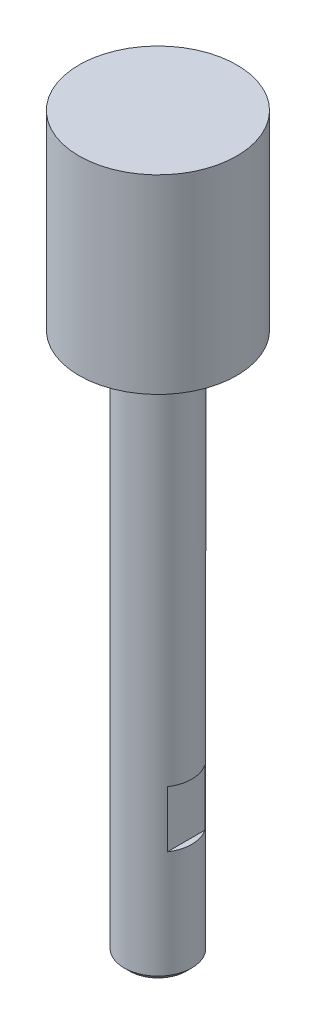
ISO-10303-21;
HEADER;
FILE_DESCRIPTION(('STEP AP214'),'2;1');
FILE_NAME('part.step','',(''),(''),'','','');
FILE_SCHEMA(('AUTOMOTIVE_DESIGN { 1 0 10303 214 1 1 1 1 }'));
ENDSEC;
DATA;
#1=APPLICATION_CONTEXT('core data for automotive mechanical design processes');
#2=APPLICATION_PROTOCOL_DEFINITION('international standard','automotive_design',2000,#1);
#3=PRODUCT_CONTEXT('',#1,'mechanical');
#4=PRODUCT('Part','Part','',(#3));
#5=PRODUCT_RELATED_PRODUCT_CATEGORY('part','',(#4));
#6=PRODUCT_DEFINITION_FORMATION('','',#4);
#7=PRODUCT_DEFINITION_CONTEXT('part definition',#1,'design');
#8=PRODUCT_DEFINITION('design','',#6,#7);
#9=PRODUCT_DEFINITION_SHAPE('','',#8);
#10=(LENGTH_UNIT() NAMED_UNIT(*) SI_UNIT(.MILLI.,.METRE.));
#11=(NAMED_UNIT(*) PLANE_ANGLE_UNIT() SI_UNIT($,.RADIAN.));
#12=(NAMED_UNIT(*) SI_UNIT($,.STERADIAN.) SOLID_ANGLE_UNIT());
#13=UNCERTAINTY_MEASURE_WITH_UNIT(LENGTH_MEASURE(1.E-05),#10,'distance_accuracy_value','');
#14=(GEOMETRIC_REPRESENTATION_CONTEXT(3) GLOBAL_UNCERTAINTY_ASSIGNED_CONTEXT((#13)) GLOBAL_UNIT_ASSIGNED_CONTEXT((#10,
#11,#12)) REPRESENTATION_CONTEXT('',''));
#15=CARTESIAN_POINT('',(0.,0.,0.));
#16=DIRECTION('',(0.,0.,1.));
#17=DIRECTION('',(1.,0.,0.));
#18=AXIS2_PLACEMENT_3D('',#15,#16,#17);
#19=CARTESIAN_POINT('',(0.,0.,0.));
#20=DIRECTION('',(0.,1.,0.));
#21=DIRECTION('',(0.,0.,1.));
#22=AXIS2_PLACEMENT_3D('',#19,#20,#21);
#23=PLANE('',#22);
#24=CARTESIAN_POINT('',(0.,0.,0.));
#25=DIRECTION('',(0.,1.,0.));
#26=DIRECTION('',(0.,0.,1.));
#27=AXIS2_PLACEMENT_3D('',#24,#25,#26);
#28=CIRCLE('',#27,11.1125);
#29=CARTESIAN_POINT('',(0.,0.,11.1125));
#30=VERTEX_POINT('',#29);
#31=EDGE_CURVE('E136',#30,#30,#28,.T.);
#32=ORIENTED_EDGE('',*,*,#31,.F.);
#33=EDGE_LOOP('',(#32));
#34=FACE_BOUND('',#33,.T.);
#35=CARTESIAN_POINT('',(0.,0.,0.));
#36=DIRECTION('',(0.,1.,0.));
#37=DIRECTION('',(0.,0.,1.));
#38=AXIS2_PLACEMENT_3D('',#35,#36,#37);
#39=CIRCLE('',#38,4.7625);
#40=CARTESIAN_POINT('',(0.,0.,4.7625));
#41=VERTEX_POINT('',#40);
#42=EDGE_CURVE('E135',#41,#41,#39,.F.);
#43=ORIENTED_EDGE('',*,*,#42,.F.);
#44=EDGE_LOOP('',(#43));
#45=FACE_BOUND('',#44,.T.);
#46=ADVANCED_FACE('F37',(#34,#45),#23,.F.);
#47=CARTESIAN_POINT('',(0.,26.7716,0.));
#48=DIRECTION('',(0.,-1.,0.));
#49=DIRECTION('',(0.,0.,-1.));
#50=AXIS2_PLACEMENT_3D('',#47,#48,#49);
#51=CYLINDRICAL_SURFACE('',#50,11.1125);
#52=CARTESIAN_POINT('',(0.,26.7716,0.));
#53=DIRECTION('',(0.,1.,0.));
#54=DIRECTION('',(0.,0.,1.));
#55=AXIS2_PLACEMENT_3D('',#52,#53,#54);
#56=CIRCLE('',#55,11.1125);
#57=CARTESIAN_POINT('',(0.,26.7716,11.1125));
#58=VERTEX_POINT('',#57);
#59=EDGE_CURVE('E134',#58,#58,#56,.T.);
#60=ORIENTED_EDGE('',*,*,#59,.F.);
#61=EDGE_LOOP('',(#60));
#62=FACE_BOUND('',#61,.T.);
#63=ORIENTED_EDGE('',*,*,#31,.T.);
#64=EDGE_LOOP('',(#63));
#65=FACE_BOUND('',#64,.T.);
#66=ADVANCED_FACE('F39',(#62,#65),#51,.T.);
#67=CARTESIAN_POINT('',(0.,26.7716,0.));
#68=DIRECTION('',(0.,1.,0.));
#69=DIRECTION('',(0.,0.,1.));
#70=AXIS2_PLACEMENT_3D('',#67,#68,#69);
#71=PLANE('',#70);
#72=ORIENTED_EDGE('',*,*,#59,.T.);
#73=EDGE_LOOP('',(#72));
#74=FACE_BOUND('',#73,.T.);
#75=ADVANCED_FACE('F120',(#74),#71,.T.);
#76=CARTESIAN_POINT('',(0.,-76.2,0.));
#77=DIRECTION('',(0.,1.,0.));
#78=DIRECTION('',(0.,0.,1.));
#79=AXIS2_PLACEMENT_3D('',#76,#77,#78);
#80=CYLINDRICAL_SURFACE('',#79,4.7625);
#81=CARTESIAN_POINT('',(0.,-75.4126,0.));
#82=DIRECTION('',(0.,-1.,0.));
#83=DIRECTION('',(0.,0.,-1.));
#84=AXIS2_PLACEMENT_3D('',#81,#82,#83);
#85=CIRCLE('',#84,4.7625);
#86=CARTESIAN_POINT('',(0.,-75.4126,-4.7625));
#87=VERTEX_POINT('',#86);
#88=EDGE_CURVE('E11',#87,#87,#85,.F.);
#89=ORIENTED_EDGE('',*,*,#88,.T.);
#90=EDGE_LOOP('',(#89));
#91=FACE_BOUND('',#90,.T.);
#92=DIRECTION('',(0.,1.,0.));
#93=VECTOR('',#92,1.);
#94=CARTESIAN_POINT('',(-3.96747999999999,-76.2,-2.63448452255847));
#95=LINE('',#94,#93);
#96=CARTESIAN_POINT('',(-3.96747999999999,-60.325,-2.63448452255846));
#97=VERTEX_POINT('',#96);
#98=CARTESIAN_POINT('',(-3.96747999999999,-52.3875,-2.63448452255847));
#99=VERTEX_POINT('',#98);
#100=EDGE_CURVE('E88',#97,#99,#95,.T.);
#101=ORIENTED_EDGE('',*,*,#100,.T.);
#102=CARTESIAN_POINT('',(0.,-52.3875,0.));
#103=DIRECTION('',(0.,1.,0.));
#104=DIRECTION('',(0.,0.,1.));
#105=AXIS2_PLACEMENT_3D('',#102,#103,#104);
#106=CIRCLE('',#105,4.7625);
#107=CARTESIAN_POINT('',(-3.96747999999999,-52.3875,2.63448452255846));
#108=VERTEX_POINT('',#107);
#109=EDGE_CURVE('E94',#99,#108,#106,.T.);
#110=ORIENTED_EDGE('',*,*,#109,.T.);
#111=DIRECTION('',(0.,1.,0.));
#112=VECTOR('',#111,1.);
#113=CARTESIAN_POINT('',(-3.96747999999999,-76.2,2.63448452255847));
#114=LINE('',#113,#112);
#115=CARTESIAN_POINT('',(-3.96747999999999,-60.325,2.63448452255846));
#116=VERTEX_POINT('',#115);
#117=EDGE_CURVE('E81',#108,#116,#114,.F.);
#118=ORIENTED_EDGE('',*,*,#117,.T.);
#119=CARTESIAN_POINT('',(0.,-60.325,0.));
#120=DIRECTION('',(0.,-1.,0.));
#121=DIRECTION('',(0.,0.,-1.));
#122=AXIS2_PLACEMENT_3D('',#119,#120,#121);
#123=CIRCLE('',#122,4.7625);
#124=EDGE_CURVE('E76',#116,#97,#123,.T.);
#125=ORIENTED_EDGE('',*,*,#124,.T.);
#126=EDGE_LOOP('',(#101,#110,#118,#125));
#127=FACE_BOUND('',#126,.T.);
#128=DIRECTION('',(0.,1.,0.));
#129=VECTOR('',#128,1.);
#130=CARTESIAN_POINT('',(3.96748000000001,-76.2,2.63448452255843));
#131=LINE('',#130,#129);
#132=CARTESIAN_POINT('',(3.96748000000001,-60.325,2.63448452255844));
#133=VERTEX_POINT('',#132);
#134=CARTESIAN_POINT('',(3.96748000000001,-52.3875,2.63448452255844));
#135=VERTEX_POINT('',#134);
#136=EDGE_CURVE('E151',#133,#135,#131,.T.);
#137=ORIENTED_EDGE('',*,*,#136,.T.);
#138=CARTESIAN_POINT('',(0.,-52.3875,0.));
#139=DIRECTION('',(0.,1.,0.));
#140=DIRECTION('',(0.,0.,1.));
#141=AXIS2_PLACEMENT_3D('',#138,#139,#140);
#142=CIRCLE('',#141,4.7625);
#143=CARTESIAN_POINT('',(3.96748000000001,-52.3875,-2.63448452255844));
#144=VERTEX_POINT('',#143);
#145=EDGE_CURVE('E82',#135,#144,#142,.T.);
#146=ORIENTED_EDGE('',*,*,#145,.T.);
#147=DIRECTION('',(0.,1.,0.));
#148=VECTOR('',#147,1.);
#149=CARTESIAN_POINT('',(3.96748000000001,-76.2,-2.63448452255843));
#150=LINE('',#149,#148);
#151=CARTESIAN_POINT('',(3.96748000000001,-60.325,-2.63448452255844));
#152=VERTEX_POINT('',#151);
#153=EDGE_CURVE('E148',#144,#152,#150,.F.);
#154=ORIENTED_EDGE('',*,*,#153,.T.);
#155=CARTESIAN_POINT('',(0.,-60.325,0.));
#156=DIRECTION('',(0.,-1.,0.));
#157=DIRECTION('',(0.,0.,-1.));
#158=AXIS2_PLACEMENT_3D('',#155,#156,#157);
#159=CIRCLE('',#158,4.7625);
#160=EDGE_CURVE('E139',#152,#133,#159,.T.);
#161=ORIENTED_EDGE('',*,*,#160,.T.);
#162=EDGE_LOOP('',(#137,#146,#154,#161));
#163=FACE_BOUND('',#162,.T.);
#164=ORIENTED_EDGE('',*,*,#42,.T.);
#165=EDGE_LOOP('',(#164));
#166=FACE_BOUND('',#165,.T.);
#167=ADVANCED_FACE('F92',(#91,#127,#163,#166),#80,.T.);
#168=CARTESIAN_POINT('',(0.,-76.2,0.));
#169=DIRECTION('',(0.,-1.,0.));
#170=DIRECTION('',(0.,0.,-1.));
#171=AXIS2_PLACEMENT_3D('',#168,#169,#170);
#172=PLANE('',#171);
#173=CARTESIAN_POINT('',(0.,-76.2,0.));
#174=DIRECTION('',(0.,-1.,0.));
#175=DIRECTION('',(0.,0.,-1.));
#176=AXIS2_PLACEMENT_3D('',#173,#174,#175);
#177=CIRCLE('',#176,3.97510000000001);
#178=CARTESIAN_POINT('',(0.,-76.2,-3.97510000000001));
#179=VERTEX_POINT('',#178);
#180=EDGE_CURVE('E45',#179,#179,#177,.T.);
#181=ORIENTED_EDGE('',*,*,#180,.T.);
#182=EDGE_LOOP('',(#181));
#183=FACE_BOUND('',#182,.T.);
#184=ADVANCED_FACE('F102',(#183),#172,.T.);
#185=CARTESIAN_POINT('',(3.96748000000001,-52.3875,-13.937));
#186=DIRECTION('',(-1.,0.,0.));
#187=DIRECTION('',(0.,-1.,0.));
#188=AXIS2_PLACEMENT_3D('',#185,#186,#187);
#189=PLANE('',#188);
#190=DIRECTION('',(0.,0.,1.));
#191=VECTOR('',#190,1.);
#192=CARTESIAN_POINT('',(3.96748000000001,-60.325,-13.937));
#193=LINE('',#192,#191);
#194=EDGE_CURVE('E58',#152,#133,#193,.T.);
#195=ORIENTED_EDGE('',*,*,#194,.F.);
#196=ORIENTED_EDGE('',*,*,#153,.F.);
#197=DIRECTION('',(0.,0.,1.));
#198=VECTOR('',#197,1.);
#199=CARTESIAN_POINT('',(3.96748000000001,-52.3875,-13.937));
#200=LINE('',#199,#198);
#201=EDGE_CURVE('E142',#144,#135,#200,.T.);
#202=ORIENTED_EDGE('',*,*,#201,.T.);
#203=ORIENTED_EDGE('',*,*,#136,.F.);
#204=EDGE_LOOP('',(#195,#196,#202,#203));
#205=FACE_BOUND('',#204,.T.);
#206=ADVANCED_FACE('F160',(#205),#189,.F.);
#207=CARTESIAN_POINT('',(3.96748000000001,-52.3875,-13.937));
#208=DIRECTION('',(0.,1.,0.));
#209=DIRECTION('',(0.,0.,1.));
#210=AXIS2_PLACEMENT_3D('',#207,#208,#209);
#211=PLANE('',#210);
#212=ORIENTED_EDGE('',*,*,#201,.F.);
#213=ORIENTED_EDGE('',*,*,#145,.F.);
#214=EDGE_LOOP('',(#212,#213));
#215=FACE_BOUND('',#214,.T.);
#216=ADVANCED_FACE('F158',(#215),#211,.F.);
#217=CARTESIAN_POINT('',(3.96748000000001,-60.325,-13.937));
#218=DIRECTION('',(0.,-1.,0.));
#219=DIRECTION('',(0.,0.,-1.));
#220=AXIS2_PLACEMENT_3D('',#217,#218,#219);
#221=PLANE('',#220);
#222=ORIENTED_EDGE('',*,*,#194,.T.);
#223=ORIENTED_EDGE('',*,*,#160,.F.);
#224=EDGE_LOOP('',(#222,#223));
#225=FACE_BOUND('',#224,.T.);
#226=ADVANCED_FACE('F166',(#225),#221,.F.);
#227=CARTESIAN_POINT('',(-3.96747999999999,-52.3875,-13.937));
#228=DIRECTION('',(0.,1.,0.));
#229=DIRECTION('',(0.,0.,1.));
#230=AXIS2_PLACEMENT_3D('',#227,#228,#229);
#231=PLANE('',#230);
#232=DIRECTION('',(0.,0.,1.));
#233=VECTOR('',#232,1.);
#234=CARTESIAN_POINT('',(-3.96747999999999,-52.3875,-13.937));
#235=LINE('',#234,#233);
#236=EDGE_CURVE('E89',#99,#108,#235,.T.);
#237=ORIENTED_EDGE('',*,*,#236,.T.);
#238=ORIENTED_EDGE('',*,*,#109,.F.);
#239=EDGE_LOOP('',(#237,#238));
#240=FACE_BOUND('',#239,.T.);
#241=ADVANCED_FACE('F164',(#240),#231,.F.);
#242=CARTESIAN_POINT('',(-3.96747999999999,-52.3875,-13.937));
#243=DIRECTION('',(1.,0.,0.));
#244=DIRECTION('',(0.,1.,0.));
#245=AXIS2_PLACEMENT_3D('',#242,#243,#244);
#246=PLANE('',#245);
#247=DIRECTION('',(0.,0.,1.));
#248=VECTOR('',#247,1.);
#249=CARTESIAN_POINT('',(-3.96747999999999,-60.325,-13.937));
#250=LINE('',#249,#248);
#251=EDGE_CURVE('E51',#97,#116,#250,.T.);
#252=ORIENTED_EDGE('',*,*,#251,.T.);
#253=ORIENTED_EDGE('',*,*,#117,.F.);
#254=ORIENTED_EDGE('',*,*,#236,.F.);
#255=ORIENTED_EDGE('',*,*,#100,.F.);
#256=EDGE_LOOP('',(#252,#253,#254,#255));
#257=FACE_BOUND('',#256,.T.);
#258=ADVANCED_FACE('F85',(#257),#246,.F.);
#259=CARTESIAN_POINT('',(-3.96747999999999,-60.325,-13.937));
#260=DIRECTION('',(0.,-1.,0.));
#261=DIRECTION('',(0.,0.,-1.));
#262=AXIS2_PLACEMENT_3D('',#259,#260,#261);
#263=PLANE('',#262);
#264=ORIENTED_EDGE('',*,*,#251,.F.);
#265=ORIENTED_EDGE('',*,*,#124,.F.);
#266=EDGE_LOOP('',(#264,#265));
#267=FACE_BOUND('',#266,.T.);
#268=ADVANCED_FACE('F77',(#267),#263,.F.);
#269=CARTESIAN_POINT('',(0.,-76.2,0.));
#270=DIRECTION('',(0.,1.,0.));
#271=DIRECTION('',(0.,0.,1.));
#272=AXIS2_PLACEMENT_3D('',#269,#270,#271);
#273=CONICAL_SURFACE('',#272,3.97510000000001,0.785398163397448);
#274=ORIENTED_EDGE('',*,*,#88,.F.);
#275=EDGE_LOOP('',(#274));
#276=FACE_BOUND('',#275,.T.);
#277=ORIENTED_EDGE('',*,*,#180,.F.);
#278=EDGE_LOOP('',(#277));
#279=FACE_BOUND('',#278,.T.);
#280=ADVANCED_FACE('F104',(#276,#279),#273,.T.);
#281=CLOSED_SHELL('',(#46,#66,#75,#167,#184,#206,#216,#226,#241,#258,#268,#280));
#282=MANIFOLD_SOLID_BREP('B2',#281);
#283=ADVANCED_BREP_SHAPE_REPRESENTATION('',(#18,#282),#14);
#284=SHAPE_DEFINITION_REPRESENTATION(#9,#283);
ENDSEC;
END-ISO-10303-21;
